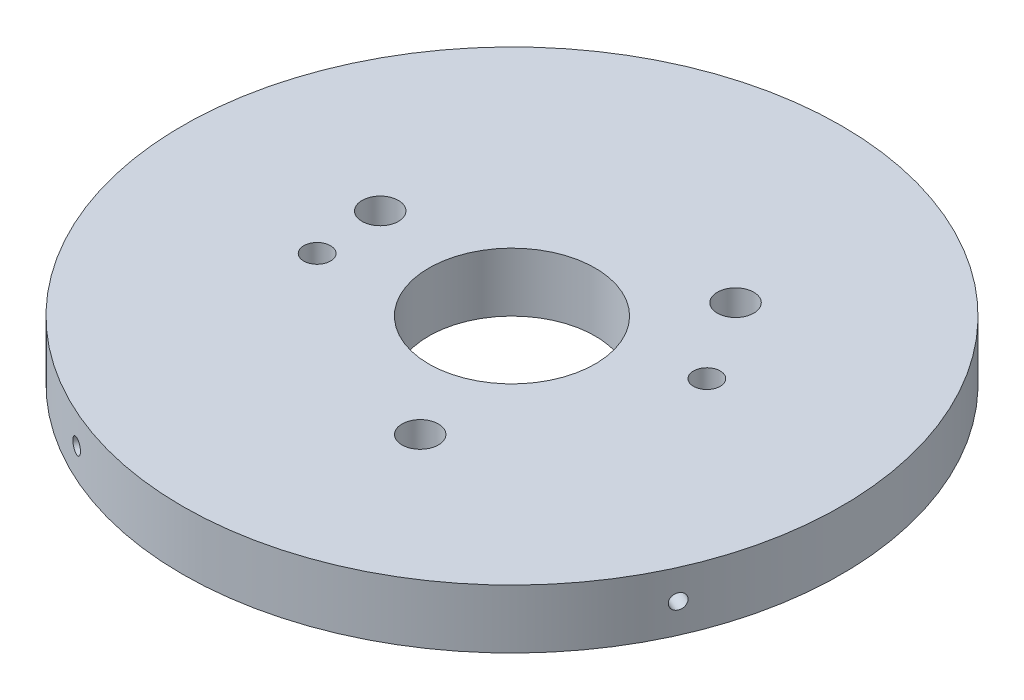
from build123d import *

# Parameters (mm, degrees)
SKETCH1_R                               = 49.7713
SKETCH1_R_2                             = 12.5603
BOSS_EXTRUDE1_DEPTH                     = 8.89
CBORE_FOR_M5_HEX_HEAD_BOLT1_D           = 5.5
CBORE_FOR_M5_HEX_HEAD_BOLT1_CBORE_D     = 12.24
CBORE_FOR_M5_HEX_HEAD_BOLT1_CBORE_DEPTH = 3.58
CIRPATTERN1_COUNT                       = 4
F_10_32_TAPPED_HOLE1_D                  = 4.0386


with BuildPart() as part:
    # Sketch1 → Boss-Extrude1 (new body)
    with BuildSketch(Plane(origin=(0, 0, 0), x_dir=(1, 0, 0), z_dir=(0, 1, 0))):
        with Locations(Location((0, 0, 0), (0, 0, 270))):
            Circle(SKETCH1_R)
        with Locations(Location((0, 0, 0), (0, 0, 270))):
            Circle(SKETCH1_R_2, mode=Mode.SUBTRACT)
    extrude(amount=BOSS_EXTRUDE1_DEPTH)

    # CBORE for M5 Hex Head Bolt1 (through all)
    with Locations(Plane(origin=(0, 0, 0), x_dir=(-1, 0, 0), z_dir=(0, -1, 0))):
        with Locations((-15.138298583, 18.623423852), (-8.559208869, -22.42186307), (23.697507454, 3.798439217)):
            CounterBoreHole(CBORE_FOR_M5_HEX_HEAD_BOLT1_D / 2, CBORE_FOR_M5_HEX_HEAD_BOLT1_CBORE_D / 2, CBORE_FOR_M5_HEX_HEAD_BOLT1_CBORE_DEPTH)

    # Sketch6 → 4-40 Tapped Hole1 (revolve, cut)
    with BuildSketch(Plane(origin=(-20.331067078, 4.445, 45.429395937), x_dir=(0.9127628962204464, 0, 0.4084897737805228), z_dir=(0, 1, 0))):
        Polygon((0, 0), (0, 10.839152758), (1.1303, 10.16), (1.1303, 0), align=None)
    f_4_40_tapped_hole1 = revolve(axis=Axis((-22.924977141, 4.445, 51.225440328), (0.4084897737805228, 0, -0.9127628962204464)), mode=Mode.SUBTRACT)

    # CirPattern1: 4-40 Tapped Hole1 ×4 about axis
    cirpattern1_axis = Axis((0, 6.6675, 0), (0, -1, 0))
    for i in range(1, CIRPATTERN1_COUNT):
        add(f_4_40_tapped_hole1.rotate(cirpattern1_axis, i * 360 / CIRPATTERN1_COUNT), mode=Mode.SUBTRACT)

    # 10-32 Tapped Hole1 (through all)
    with Locations(Plane(origin=(0, 0, 0), x_dir=(-1, 0, 0), z_dir=(0, -1, 0))):
        with Locations((22.905212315, -6.52195683), (-22.905212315, 6.52195683)):
            Hole(F_10_32_TAPPED_HOLE1_D / 2)


solid = part.part
